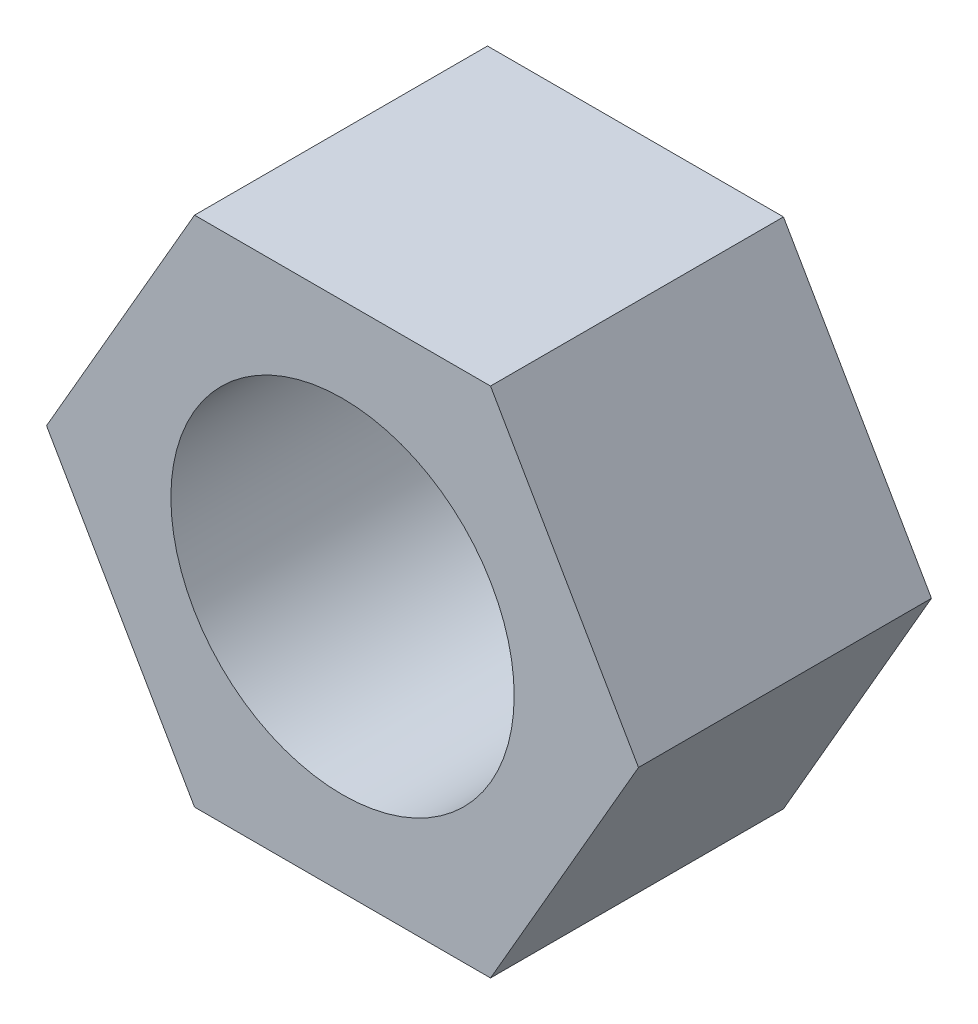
ISO-10303-21;
HEADER;
FILE_DESCRIPTION(('STEP AP214'),'2;1');
FILE_NAME('part.step','',(''),(''),'','','');
FILE_SCHEMA(('AUTOMOTIVE_DESIGN { 1 0 10303 214 1 1 1 1 }'));
ENDSEC;
DATA;
#1=APPLICATION_CONTEXT('core data for automotive mechanical design processes');
#2=APPLICATION_PROTOCOL_DEFINITION('international standard','automotive_design',2000,#1);
#3=PRODUCT_CONTEXT('',#1,'mechanical');
#4=PRODUCT('Part','Part','',(#3));
#5=PRODUCT_RELATED_PRODUCT_CATEGORY('part','',(#4));
#6=PRODUCT_DEFINITION_FORMATION('','',#4);
#7=PRODUCT_DEFINITION_CONTEXT('part definition',#1,'design');
#8=PRODUCT_DEFINITION('design','',#6,#7);
#9=PRODUCT_DEFINITION_SHAPE('','',#8);
#10=(LENGTH_UNIT() NAMED_UNIT(*) SI_UNIT(.MILLI.,.METRE.));
#11=(NAMED_UNIT(*) PLANE_ANGLE_UNIT() SI_UNIT($,.RADIAN.));
#12=(NAMED_UNIT(*) SI_UNIT($,.STERADIAN.) SOLID_ANGLE_UNIT());
#13=UNCERTAINTY_MEASURE_WITH_UNIT(LENGTH_MEASURE(1.E-05),#10,'distance_accuracy_value','');
#14=(GEOMETRIC_REPRESENTATION_CONTEXT(3) GLOBAL_UNCERTAINTY_ASSIGNED_CONTEXT((#13)) GLOBAL_UNIT_ASSIGNED_CONTEXT((#10,
#11,#12)) REPRESENTATION_CONTEXT('',''));
#15=CARTESIAN_POINT('',(0.,0.,0.));
#16=DIRECTION('',(0.,0.,1.));
#17=DIRECTION('',(1.,0.,0.));
#18=AXIS2_PLACEMENT_3D('',#15,#16,#17);
#19=CARTESIAN_POINT('',(-24.6366906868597,-14.224,16.256));
#20=DIRECTION('',(0.,0.,1.));
#21=DIRECTION('',(1.,0.,0.));
#22=AXIS2_PLACEMENT_3D('',#19,#20,#21);
#23=PLANE('',#22);
#24=DIRECTION('',(-0.5,-0.866025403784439,0.));
#25=VECTOR('',#24,1.);
#26=CARTESIAN_POINT('',(-8.21223022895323,14.224,16.256));
#27=LINE('',#26,#25);
#28=CARTESIAN_POINT('',(-8.21223022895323,14.224,16.256));
#29=VERTEX_POINT('',#28);
#30=CARTESIAN_POINT('',(-16.4244604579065,0.,16.256));
#31=VERTEX_POINT('',#30);
#32=EDGE_CURVE('E112',#29,#31,#27,.T.);
#33=ORIENTED_EDGE('',*,*,#32,.T.);
#34=DIRECTION('',(0.5,-0.866025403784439,0.));
#35=VECTOR('',#34,1.);
#36=CARTESIAN_POINT('',(-16.4244604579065,0.,16.256));
#37=LINE('',#36,#35);
#38=CARTESIAN_POINT('',(-8.21223022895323,-14.224,16.256));
#39=VERTEX_POINT('',#38);
#40=EDGE_CURVE('E93',#31,#39,#37,.T.);
#41=ORIENTED_EDGE('',*,*,#40,.T.);
#42=DIRECTION('',(1.,0.,0.));
#43=VECTOR('',#42,1.);
#44=CARTESIAN_POINT('',(-8.21223022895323,-14.224,16.256));
#45=LINE('',#44,#43);
#46=CARTESIAN_POINT('',(8.21223022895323,-14.224,16.256));
#47=VERTEX_POINT('',#46);
#48=EDGE_CURVE('E115',#39,#47,#45,.T.);
#49=ORIENTED_EDGE('',*,*,#48,.T.);
#50=DIRECTION('',(0.5,0.866025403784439,0.));
#51=VECTOR('',#50,1.);
#52=CARTESIAN_POINT('',(8.21223022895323,-14.224,16.256));
#53=LINE('',#52,#51);
#54=CARTESIAN_POINT('',(16.4244604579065,0.,16.256));
#55=VERTEX_POINT('',#54);
#56=EDGE_CURVE('E117',#47,#55,#53,.T.);
#57=ORIENTED_EDGE('',*,*,#56,.T.);
#58=DIRECTION('',(-0.5,0.866025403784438,0.));
#59=VECTOR('',#58,1.);
#60=CARTESIAN_POINT('',(16.4244604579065,0.,16.256));
#61=LINE('',#60,#59);
#62=CARTESIAN_POINT('',(8.21223022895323,14.224,16.256));
#63=VERTEX_POINT('',#62);
#64=EDGE_CURVE('E46',#55,#63,#61,.T.);
#65=ORIENTED_EDGE('',*,*,#64,.T.);
#66=DIRECTION('',(-1.,0.,0.));
#67=VECTOR('',#66,1.);
#68=CARTESIAN_POINT('',(8.21223022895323,14.224,16.256));
#69=LINE('',#68,#67);
#70=EDGE_CURVE('E41',#63,#29,#69,.T.);
#71=ORIENTED_EDGE('',*,*,#70,.T.);
#72=EDGE_LOOP('',(#33,#41,#49,#57,#65,#71));
#73=FACE_BOUND('',#72,.T.);
#74=CARTESIAN_POINT('',(0.,0.,16.256));
#75=DIRECTION('',(0.,0.,1.));
#76=DIRECTION('',(1.,0.,0.));
#77=AXIS2_PLACEMENT_3D('',#74,#75,#76);
#78=CIRCLE('',#77,9.525);
#79=CARTESIAN_POINT('',(9.525,0.,16.256));
#80=VERTEX_POINT('',#79);
#81=EDGE_CURVE('E98',#80,#80,#78,.T.);
#82=ORIENTED_EDGE('',*,*,#81,.F.);
#83=EDGE_LOOP('',(#82));
#84=FACE_BOUND('',#83,.T.);
#85=ADVANCED_FACE('F26',(#73,#84),#23,.T.);
#86=CARTESIAN_POINT('',(-24.6366906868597,-14.224,0.));
#87=DIRECTION('',(0.,0.,1.));
#88=DIRECTION('',(1.,0.,0.));
#89=AXIS2_PLACEMENT_3D('',#86,#87,#88);
#90=PLANE('',#89);
#91=DIRECTION('',(-0.5,-0.866025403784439,0.));
#92=VECTOR('',#91,1.);
#93=CARTESIAN_POINT('',(-8.21223022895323,14.224,0.));
#94=LINE('',#93,#92);
#95=CARTESIAN_POINT('',(-8.21223022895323,14.224,0.));
#96=VERTEX_POINT('',#95);
#97=CARTESIAN_POINT('',(-16.4244604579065,0.,0.));
#98=VERTEX_POINT('',#97);
#99=EDGE_CURVE('E84',#96,#98,#94,.T.);
#100=ORIENTED_EDGE('',*,*,#99,.F.);
#101=DIRECTION('',(-1.,0.,0.));
#102=VECTOR('',#101,1.);
#103=CARTESIAN_POINT('',(8.21223022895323,14.224,0.));
#104=LINE('',#103,#102);
#105=CARTESIAN_POINT('',(8.21223022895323,14.224,0.));
#106=VERTEX_POINT('',#105);
#107=EDGE_CURVE('E110',#106,#96,#104,.T.);
#108=ORIENTED_EDGE('',*,*,#107,.F.);
#109=DIRECTION('',(-0.5,0.866025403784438,0.));
#110=VECTOR('',#109,1.);
#111=CARTESIAN_POINT('',(16.4244604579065,0.,0.));
#112=LINE('',#111,#110);
#113=CARTESIAN_POINT('',(16.4244604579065,0.,0.));
#114=VERTEX_POINT('',#113);
#115=EDGE_CURVE('E108',#114,#106,#112,.T.);
#116=ORIENTED_EDGE('',*,*,#115,.F.);
#117=DIRECTION('',(0.5,0.866025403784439,0.));
#118=VECTOR('',#117,1.);
#119=CARTESIAN_POINT('',(8.21223022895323,-14.224,0.));
#120=LINE('',#119,#118);
#121=CARTESIAN_POINT('',(8.21223022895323,-14.224,0.));
#122=VERTEX_POINT('',#121);
#123=EDGE_CURVE('E106',#122,#114,#120,.T.);
#124=ORIENTED_EDGE('',*,*,#123,.F.);
#125=DIRECTION('',(1.,0.,0.));
#126=VECTOR('',#125,1.);
#127=CARTESIAN_POINT('',(-8.21223022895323,-14.224,0.));
#128=LINE('',#127,#126);
#129=CARTESIAN_POINT('',(-8.21223022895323,-14.224,0.));
#130=VERTEX_POINT('',#129);
#131=EDGE_CURVE('E86',#130,#122,#128,.T.);
#132=ORIENTED_EDGE('',*,*,#131,.F.);
#133=DIRECTION('',(0.5,-0.866025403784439,0.));
#134=VECTOR('',#133,1.);
#135=CARTESIAN_POINT('',(-16.4244604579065,0.,0.));
#136=LINE('',#135,#134);
#137=EDGE_CURVE('E79',#98,#130,#136,.T.);
#138=ORIENTED_EDGE('',*,*,#137,.F.);
#139=EDGE_LOOP('',(#100,#108,#116,#124,#132,#138));
#140=FACE_BOUND('',#139,.T.);
#141=CARTESIAN_POINT('',(0.,0.,0.));
#142=DIRECTION('',(0.,0.,1.));
#143=DIRECTION('',(1.,0.,0.));
#144=AXIS2_PLACEMENT_3D('',#141,#142,#143);
#145=CIRCLE('',#144,9.525);
#146=CARTESIAN_POINT('',(9.525,0.,0.));
#147=VERTEX_POINT('',#146);
#148=EDGE_CURVE('E101',#147,#147,#145,.T.);
#149=ORIENTED_EDGE('',*,*,#148,.T.);
#150=EDGE_LOOP('',(#149));
#151=FACE_BOUND('',#150,.T.);
#152=ADVANCED_FACE('F80',(#140,#151),#90,.F.);
#153=CARTESIAN_POINT('',(-8.21223022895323,14.224,16.256));
#154=DIRECTION('',(0.866025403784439,-0.5,0.));
#155=DIRECTION('',(0.5,0.866025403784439,0.));
#156=AXIS2_PLACEMENT_3D('',#153,#154,#155);
#157=PLANE('',#156);
#158=ORIENTED_EDGE('',*,*,#99,.T.);
#159=DIRECTION('',(0.,0.,-1.));
#160=VECTOR('',#159,1.);
#161=CARTESIAN_POINT('',(-16.4244604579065,0.,16.256));
#162=LINE('',#161,#160);
#163=EDGE_CURVE('E11',#31,#98,#162,.T.);
#164=ORIENTED_EDGE('',*,*,#163,.F.);
#165=ORIENTED_EDGE('',*,*,#32,.F.);
#166=DIRECTION('',(0.,0.,-1.));
#167=VECTOR('',#166,1.);
#168=CARTESIAN_POINT('',(-8.21223022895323,14.224,16.256));
#169=LINE('',#168,#167);
#170=EDGE_CURVE('E97',#29,#96,#169,.T.);
#171=ORIENTED_EDGE('',*,*,#170,.T.);
#172=EDGE_LOOP('',(#158,#164,#165,#171));
#173=FACE_BOUND('',#172,.T.);
#174=ADVANCED_FACE('F28',(#173),#157,.F.);
#175=CARTESIAN_POINT('',(-16.4244604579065,0.,16.256));
#176=DIRECTION('',(0.866025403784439,0.5,0.));
#177=DIRECTION('',(-0.5,0.866025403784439,0.));
#178=AXIS2_PLACEMENT_3D('',#175,#176,#177);
#179=PLANE('',#178);
#180=ORIENTED_EDGE('',*,*,#137,.T.);
#181=DIRECTION('',(0.,0.,-1.));
#182=VECTOR('',#181,1.);
#183=CARTESIAN_POINT('',(-8.21223022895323,-14.224,16.256));
#184=LINE('',#183,#182);
#185=EDGE_CURVE('E34',#39,#130,#184,.T.);
#186=ORIENTED_EDGE('',*,*,#185,.F.);
#187=ORIENTED_EDGE('',*,*,#40,.F.);
#188=ORIENTED_EDGE('',*,*,#163,.T.);
#189=EDGE_LOOP('',(#180,#186,#187,#188));
#190=FACE_BOUND('',#189,.T.);
#191=ADVANCED_FACE('F92',(#190),#179,.F.);
#192=CARTESIAN_POINT('',(-8.21223022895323,-14.224,16.256));
#193=DIRECTION('',(0.,1.,0.));
#194=DIRECTION('',(0.,0.,1.));
#195=AXIS2_PLACEMENT_3D('',#192,#193,#194);
#196=PLANE('',#195);
#197=ORIENTED_EDGE('',*,*,#131,.T.);
#198=DIRECTION('',(0.,0.,-1.));
#199=VECTOR('',#198,1.);
#200=CARTESIAN_POINT('',(8.21223022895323,-14.224,16.256));
#201=LINE('',#200,#199);
#202=EDGE_CURVE('E128',#47,#122,#201,.T.);
#203=ORIENTED_EDGE('',*,*,#202,.F.);
#204=ORIENTED_EDGE('',*,*,#48,.F.);
#205=ORIENTED_EDGE('',*,*,#185,.T.);
#206=EDGE_LOOP('',(#197,#203,#204,#205));
#207=FACE_BOUND('',#206,.T.);
#208=ADVANCED_FACE('F132',(#207),#196,.F.);
#209=CARTESIAN_POINT('',(8.21223022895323,-14.224,16.256));
#210=DIRECTION('',(-0.866025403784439,0.5,0.));
#211=DIRECTION('',(-0.5,-0.866025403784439,0.));
#212=AXIS2_PLACEMENT_3D('',#209,#210,#211);
#213=PLANE('',#212);
#214=ORIENTED_EDGE('',*,*,#123,.T.);
#215=DIRECTION('',(0.,0.,-1.));
#216=VECTOR('',#215,1.);
#217=CARTESIAN_POINT('',(16.4244604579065,0.,16.256));
#218=LINE('',#217,#216);
#219=EDGE_CURVE('E125',#55,#114,#218,.T.);
#220=ORIENTED_EDGE('',*,*,#219,.F.);
#221=ORIENTED_EDGE('',*,*,#56,.F.);
#222=ORIENTED_EDGE('',*,*,#202,.T.);
#223=EDGE_LOOP('',(#214,#220,#221,#222));
#224=FACE_BOUND('',#223,.T.);
#225=ADVANCED_FACE('F138',(#224),#213,.F.);
#226=CARTESIAN_POINT('',(16.4244604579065,0.,16.256));
#227=DIRECTION('',(-0.866025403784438,-0.5,0.));
#228=DIRECTION('',(0.5,-0.866025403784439,0.));
#229=AXIS2_PLACEMENT_3D('',#226,#227,#228);
#230=PLANE('',#229);
#231=ORIENTED_EDGE('',*,*,#115,.T.);
#232=DIRECTION('',(0.,0.,-1.));
#233=VECTOR('',#232,1.);
#234=CARTESIAN_POINT('',(8.21223022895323,14.224,16.256));
#235=LINE('',#234,#233);
#236=EDGE_CURVE('E122',#63,#106,#235,.T.);
#237=ORIENTED_EDGE('',*,*,#236,.F.);
#238=ORIENTED_EDGE('',*,*,#64,.F.);
#239=ORIENTED_EDGE('',*,*,#219,.T.);
#240=EDGE_LOOP('',(#231,#237,#238,#239));
#241=FACE_BOUND('',#240,.T.);
#242=ADVANCED_FACE('F141',(#241),#230,.F.);
#243=CARTESIAN_POINT('',(8.21223022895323,14.224,16.256));
#244=DIRECTION('',(0.,-1.,0.));
#245=DIRECTION('',(1.,0.,0.));
#246=AXIS2_PLACEMENT_3D('',#243,#244,#245);
#247=PLANE('',#246);
#248=ORIENTED_EDGE('',*,*,#107,.T.);
#249=ORIENTED_EDGE('',*,*,#170,.F.);
#250=ORIENTED_EDGE('',*,*,#70,.F.);
#251=ORIENTED_EDGE('',*,*,#236,.T.);
#252=EDGE_LOOP('',(#248,#249,#250,#251));
#253=FACE_BOUND('',#252,.T.);
#254=ADVANCED_FACE('F143',(#253),#247,.F.);
#255=CARTESIAN_POINT('',(0.,0.,16.256));
#256=DIRECTION('',(0.,0.,-1.));
#257=DIRECTION('',(-1.,0.,0.));
#258=AXIS2_PLACEMENT_3D('',#255,#256,#257);
#259=CYLINDRICAL_SURFACE('',#258,9.525);
#260=ORIENTED_EDGE('',*,*,#81,.T.);
#261=EDGE_LOOP('',(#260));
#262=FACE_BOUND('',#261,.T.);
#263=ORIENTED_EDGE('',*,*,#148,.F.);
#264=EDGE_LOOP('',(#263));
#265=FACE_BOUND('',#264,.T.);
#266=ADVANCED_FACE('F145',(#262,#265),#259,.F.);
#267=CLOSED_SHELL('',(#85,#152,#174,#191,#208,#225,#242,#254,#266));
#268=MANIFOLD_SOLID_BREP('B2',#267);
#269=ADVANCED_BREP_SHAPE_REPRESENTATION('',(#18,#268),#14);
#270=SHAPE_DEFINITION_REPRESENTATION(#9,#269);
ENDSEC;
END-ISO-10303-21;
